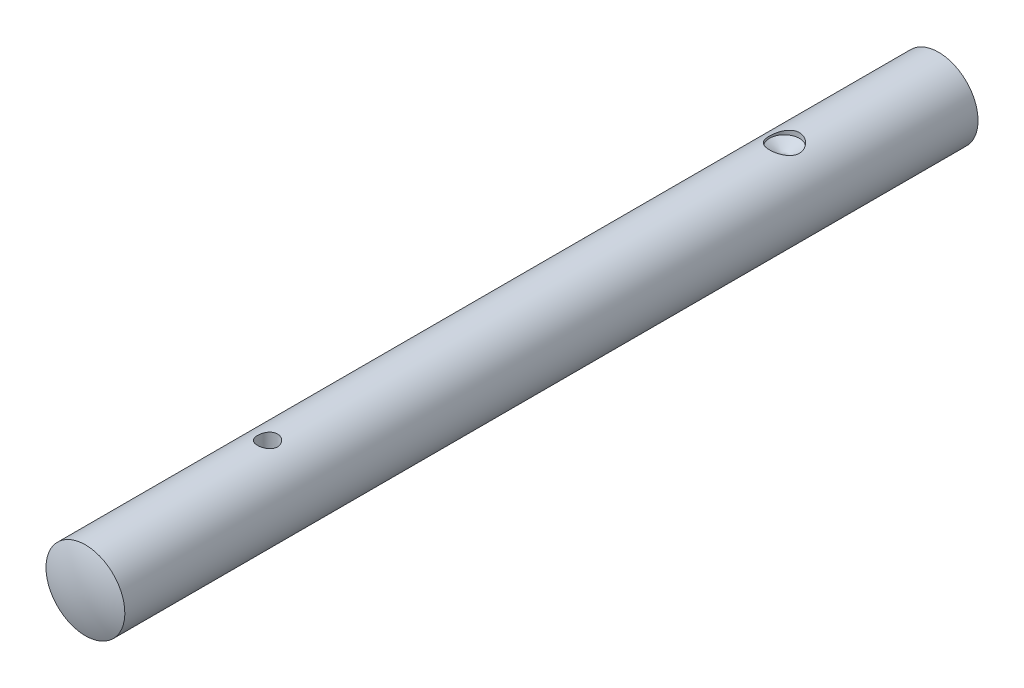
ISO-10303-21;
HEADER;
FILE_DESCRIPTION(('STEP AP214'),'2;1');
FILE_NAME('part.step','',(''),(''),'','','');
FILE_SCHEMA(('AUTOMOTIVE_DESIGN { 1 0 10303 214 1 1 1 1 }'));
ENDSEC;
DATA;
#1=APPLICATION_CONTEXT('core data for automotive mechanical design processes');
#2=APPLICATION_PROTOCOL_DEFINITION('international standard','automotive_design',2000,#1);
#3=PRODUCT_CONTEXT('',#1,'mechanical');
#4=PRODUCT('Part','Part','',(#3));
#5=PRODUCT_RELATED_PRODUCT_CATEGORY('part','',(#4));
#6=PRODUCT_DEFINITION_FORMATION('','',#4);
#7=PRODUCT_DEFINITION_CONTEXT('part definition',#1,'design');
#8=PRODUCT_DEFINITION('design','',#6,#7);
#9=PRODUCT_DEFINITION_SHAPE('','',#8);
#10=(LENGTH_UNIT() NAMED_UNIT(*) SI_UNIT(.MILLI.,.METRE.));
#11=(NAMED_UNIT(*) PLANE_ANGLE_UNIT() SI_UNIT($,.RADIAN.));
#12=(NAMED_UNIT(*) SI_UNIT($,.STERADIAN.) SOLID_ANGLE_UNIT());
#13=UNCERTAINTY_MEASURE_WITH_UNIT(LENGTH_MEASURE(1.E-05),#10,'distance_accuracy_value','');
#14=(GEOMETRIC_REPRESENTATION_CONTEXT(3) GLOBAL_UNCERTAINTY_ASSIGNED_CONTEXT((#13)) GLOBAL_UNIT_ASSIGNED_CONTEXT((#10,
#11,#12)) REPRESENTATION_CONTEXT('',''));
#15=CARTESIAN_POINT('',(0.,0.,0.));
#16=DIRECTION('',(0.,0.,1.));
#17=DIRECTION('',(1.,0.,0.));
#18=AXIS2_PLACEMENT_3D('',#15,#16,#17);
#19=CARTESIAN_POINT('',(0.,0.,-174.));
#20=DIRECTION('',(0.,0.,1.));
#21=DIRECTION('',(1.,0.,0.));
#22=AXIS2_PLACEMENT_3D('',#19,#20,#21);
#23=CYLINDRICAL_SURFACE('',#22,7.9);
#24=CARTESIAN_POINT('',(0.,0.,-172.5));
#25=DIRECTION('',(0.,0.,-1.));
#26=DIRECTION('',(-1.,0.,0.));
#27=AXIS2_PLACEMENT_3D('',#24,#25,#26);
#28=CIRCLE('',#27,7.89999999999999);
#29=CARTESIAN_POINT('',(-7.89999999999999,0.,-172.5));
#30=VERTEX_POINT('',#29);
#31=EDGE_CURVE('E77',#30,#30,#28,.T.);
#32=ORIENTED_EDGE('',*,*,#31,.F.);
#33=EDGE_LOOP('',(#32));
#34=FACE_BOUND('',#33,.T.);
#35=CARTESIAN_POINT('',(0.,0.,-1.5));
#36=DIRECTION('',(0.,0.,-1.));
#37=DIRECTION('',(-1.,0.,0.));
#38=AXIS2_PLACEMENT_3D('',#35,#36,#37);
#39=CIRCLE('',#38,7.89999999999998);
#40=CARTESIAN_POINT('',(-7.89999999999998,0.,-1.5));
#41=VERTEX_POINT('',#40);
#42=EDGE_CURVE('E79',#41,#41,#39,.T.);
#43=ORIENTED_EDGE('',*,*,#42,.T.);
#44=EDGE_LOOP('',(#43));
#45=FACE_BOUND('',#44,.T.);
#46=CARTESIAN_POINT('',(0.,7.9,-138.6));
#47=CARTESIAN_POINT('',(0.162323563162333,7.90000492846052,-138.599993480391));
#48=CARTESIAN_POINT('',(0.324603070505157,7.89495384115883,-138.613215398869));
#49=CARTESIAN_POINT('',(0.644304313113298,7.87530990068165,-138.6655331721));
#50=CARTESIAN_POINT('',(0.801726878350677,7.86071868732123,-138.704624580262));
#51=CARTESIAN_POINT('',(1.10705675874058,7.82355831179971,-138.807094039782));
#52=CARTESIAN_POINT('',(1.25498205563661,7.8010047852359,-138.870424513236));
#53=CARTESIAN_POINT('',(1.53809584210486,7.75015966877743,-139.019329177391));
#54=CARTESIAN_POINT('',(1.67328081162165,7.72186649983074,-139.104909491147));
#55=CARTESIAN_POINT('',(1.93294231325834,7.66108451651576,-139.299760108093));
#56=CARTESIAN_POINT('',(2.05679326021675,7.62847488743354,-139.409826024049));
#57=CARTESIAN_POINT('',(2.2847856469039,7.5633219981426,-139.648834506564));
#58=CARTESIAN_POINT('',(2.38892082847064,7.53077876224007,-139.777783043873));
#59=CARTESIAN_POINT('',(2.57855473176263,7.46802796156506,-140.057067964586));
#60=CARTESIAN_POINT('',(2.66316106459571,7.43796229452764,-140.208045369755));
#61=CARTESIAN_POINT('',(2.80550179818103,7.3854558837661,-140.52340717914));
#62=CARTESIAN_POINT('',(2.86324724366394,7.36301200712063,-140.687786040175));
#63=CARTESIAN_POINT('',(2.94774292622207,7.32958460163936,-141.018076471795));
#64=CARTESIAN_POINT('',(2.9756892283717,7.31816074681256,-141.183635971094));
#65=CARTESIAN_POINT('',(3.00353256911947,7.3067805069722,-141.517458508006));
#66=CARTESIAN_POINT('',(3.00344157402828,7.30681922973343,-141.685720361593));
#67=CARTESIAN_POINT('',(2.97612591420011,7.31798087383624,-142.009128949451));
#68=CARTESIAN_POINT('',(2.95057362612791,7.32842061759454,-142.164444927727));
#69=CARTESIAN_POINT('',(2.8758298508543,7.35807053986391,-142.468392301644));
#70=CARTESIAN_POINT('',(2.82663471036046,7.37728207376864,-142.617022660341));
#71=CARTESIAN_POINT('',(2.70510349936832,7.42271363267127,-142.906741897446));
#72=CARTESIAN_POINT('',(2.63234090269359,7.44906124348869,-143.047630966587));
#73=CARTESIAN_POINT('',(2.46603791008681,7.50575515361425,-143.31567956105));
#74=CARTESIAN_POINT('',(2.37249021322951,7.5361028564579,-143.442834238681));
#75=CARTESIAN_POINT('',(2.15966803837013,7.599933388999,-143.689042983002));
#76=CARTESIAN_POINT('',(2.03906303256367,7.6334879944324,-143.806931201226));
#77=CARTESIAN_POINT('',(1.779414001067,7.69815357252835,-144.02116053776));
#78=CARTESIAN_POINT('',(1.64036700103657,7.72926414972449,-144.117498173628));
#79=CARTESIAN_POINT('',(1.34474573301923,7.78618320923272,-144.287221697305));
#80=CARTESIAN_POINT('',(1.18792377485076,7.81189751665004,-144.36021000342));
#81=CARTESIAN_POINT('',(0.863006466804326,7.85442576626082,-144.478378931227));
#82=CARTESIAN_POINT('',(0.694916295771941,7.87124376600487,-144.523572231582));
#83=CARTESIAN_POINT('',(0.362038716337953,7.89336633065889,-144.582605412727));
#84=CARTESIAN_POINT('',(0.197567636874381,7.89924652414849,-144.598014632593));
#85=CARTESIAN_POINT('',(-0.131696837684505,7.90061616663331,-144.601623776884));
#86=CARTESIAN_POINT('',(-0.296490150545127,7.89610798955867,-144.589829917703));
#87=CARTESIAN_POINT('',(-0.614878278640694,7.87758675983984,-144.540553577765));
#88=CARTESIAN_POINT('',(-0.768658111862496,7.86395727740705,-144.504107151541));
#89=CARTESIAN_POINT('',(-1.06780562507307,7.82895197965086,-144.40793284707));
#90=CARTESIAN_POINT('',(-1.21317220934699,7.80757515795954,-144.348201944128));
#91=CARTESIAN_POINT('',(-1.49620091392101,7.75839143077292,-144.205237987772));
#92=CARTESIAN_POINT('',(-1.63350675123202,7.73041265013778,-144.121360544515));
#93=CARTESIAN_POINT('',(-1.89255944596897,7.67110861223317,-143.933210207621));
#94=CARTESIAN_POINT('',(-2.01430042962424,7.63978209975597,-143.828929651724));
#95=CARTESIAN_POINT('',(-2.24635084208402,7.57491147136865,-143.595634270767));
#96=CARTESIAN_POINT('',(-2.35554865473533,7.5413463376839,-143.465516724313));
#97=CARTESIAN_POINT('',(-2.55078898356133,7.47757010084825,-143.188155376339));
#98=CARTESIAN_POINT('',(-2.63682912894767,7.44735934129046,-143.040909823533));
#99=CARTESIAN_POINT('',(-2.78347589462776,7.3938095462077,-142.732083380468));
#100=CARTESIAN_POINT('',(-2.84395092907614,7.37050624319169,-142.570433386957));
#101=CARTESIAN_POINT('',(-2.93641182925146,7.33416669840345,-142.238108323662));
#102=CARTESIAN_POINT('',(-2.96841593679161,7.32112388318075,-142.06743910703));
#103=CARTESIAN_POINT('',(-3.00137459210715,7.30766976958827,-141.733999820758));
#104=CARTESIAN_POINT('',(-3.0042309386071,7.30648488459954,-141.571447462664));
#105=CARTESIAN_POINT('',(-2.98370805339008,7.31488942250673,-141.24830705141));
#106=CARTESIAN_POINT('',(-2.96033144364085,7.32447776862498,-141.08771880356));
#107=CARTESIAN_POINT('',(-2.88950106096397,7.35269714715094,-140.778307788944));
#108=CARTESIAN_POINT('',(-2.842844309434,7.37102800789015,-140.629272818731));
#109=CARTESIAN_POINT('',(-2.72748799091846,7.41448510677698,-140.341063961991));
#110=CARTESIAN_POINT('',(-2.65878278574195,7.43961308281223,-140.201892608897));
#111=CARTESIAN_POINT('',(-2.49702772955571,7.49550108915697,-139.929282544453));
#112=CARTESIAN_POINT('',(-2.40287428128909,7.52649013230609,-139.796546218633));
#113=CARTESIAN_POINT('',(-2.194585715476,7.58983751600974,-139.548150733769));
#114=CARTESIAN_POINT('',(-2.08044416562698,7.62219629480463,-139.432497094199));
#115=CARTESIAN_POINT('',(-1.82777523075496,7.68681633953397,-139.214932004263));
#116=CARTESIAN_POINT('',(-1.68823948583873,7.71897044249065,-139.114154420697));
#117=CARTESIAN_POINT('',(-1.39308007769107,7.77765724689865,-138.937499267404));
#118=CARTESIAN_POINT('',(-1.237454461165,7.80418926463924,-138.86162472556));
#119=CARTESIAN_POINT('',(-0.905552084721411,7.84980684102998,-138.73412624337));
#120=CARTESIAN_POINT('',(-0.728613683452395,7.86841215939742,-138.684035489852));
#121=CARTESIAN_POINT('',(-0.367762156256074,7.89350270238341,-138.616984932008));
#122=CARTESIAN_POINT('',(-0.183852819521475,7.8999944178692,-138.600007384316));
#123=CARTESIAN_POINT('',(0.,7.9,-138.6));
#124=B_SPLINE_CURVE_WITH_KNOTS('',3,(#46,#47,#48,#49,#50,#51,#52,#53,#54,#55,#56,#57,#58,#59,
#60,#61,#62,#63,#64,#65,#66,#67,#68,#69,#70,#71,#72,#73,#74,#75,#76,#77,#78,#79,#80,#81,#82,#83,
#84,#85,#86,#87,#88,#89,#90,#91,#92,#93,#94,#95,#96,#97,#98,#99,#100,#101,#102,#103,#104,#105,
#106,#107,#108,#109,#110,#111,#112,#113,#114,#115,#116,#117,#118,#119,#120,#121,#122,#123),
.UNSPECIFIED.,.T.,.F.,(4,2,2,2,2,2,2,2,2,2,2,2,2,2,2,2,2,2,2,2,2,2,2,2,2,2,2,2,2,2,2,2,2,2,2,2,
2,2,4),(0.,0.486292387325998,0.972501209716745,1.4577605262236,1.94315352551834,
2.44753025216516,2.95206681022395,3.47641548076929,4.00054835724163,4.50274522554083,
5.00472775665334,5.4757771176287,5.94689928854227,6.42707488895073,6.9074194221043,
7.4209362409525,7.93453598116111,8.45646550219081,8.97815676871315,9.47151821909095,
9.96476693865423,10.4384776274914,10.9122498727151,11.4000709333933,11.8880755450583,
12.4051248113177,12.9222269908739,13.4419592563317,13.9613582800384,14.4466330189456,
14.9318592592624,15.4015086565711,15.8712782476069,16.3661200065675,16.8611213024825,
17.3838725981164,17.9066874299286,18.4577729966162,19.0085631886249),.UNSPECIFIED.);
#125=CARTESIAN_POINT('',(0.,7.9,-138.6));
#126=VERTEX_POINT('',#125);
#127=EDGE_CURVE('E13',#126,#126,#124,.T.);
#128=ORIENTED_EDGE('',*,*,#127,.F.);
#129=EDGE_LOOP('',(#128));
#130=FACE_BOUND('',#129,.T.);
#131=CARTESIAN_POINT('',(0.,7.9,-36.));
#132=CARTESIAN_POINT('',(0.110455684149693,7.89999816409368,-36.0000030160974));
#133=CARTESIAN_POINT('',(0.22094479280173,7.8976604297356,-36.0091811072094));
#134=CARTESIAN_POINT('',(0.438753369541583,7.88856135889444,-36.0455941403));
#135=CARTESIAN_POINT('',(0.546071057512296,7.88179758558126,-36.0728390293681));
#136=CARTESIAN_POINT('',(0.754360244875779,7.86459496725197,-36.1444531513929));
#137=CARTESIAN_POINT('',(0.855339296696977,7.85416059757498,-36.18880153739));
#138=CARTESIAN_POINT('',(1.04842483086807,7.83072646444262,-36.293289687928));
#139=CARTESIAN_POINT('',(1.14053095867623,7.8177265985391,-36.3534300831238));
#140=CARTESIAN_POINT('',(1.31519757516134,7.79026495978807,-36.4891339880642));
#141=CARTESIAN_POINT('',(1.3975443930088,7.77578017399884,-36.5649678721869));
#142=CARTESIAN_POINT('',(1.5484973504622,7.74713314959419,-36.7293274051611));
#143=CARTESIAN_POINT('',(1.61710189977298,7.73297094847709,-36.8178545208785));
#144=CARTESIAN_POINT('',(1.7396346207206,7.7063399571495,-37.0067552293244));
#145=CARTESIAN_POINT('',(1.79332251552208,7.69390034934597,-37.1072891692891));
#146=CARTESIAN_POINT('',(1.88295228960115,7.67245912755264,-37.3163214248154));
#147=CARTESIAN_POINT('',(1.91889708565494,7.66345694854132,-37.4248184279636));
#148=CARTESIAN_POINT('',(1.97128895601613,7.65014656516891,-37.6443442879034));
#149=CARTESIAN_POINT('',(1.98812081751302,7.6457458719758,-37.7552755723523));
#150=CARTESIAN_POINT('',(2.00300778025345,7.64185997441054,-37.9784679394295));
#151=CARTESIAN_POINT('',(2.00106601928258,7.64237394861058,-38.090728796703));
#152=CARTESIAN_POINT('',(1.97876757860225,7.64817623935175,-38.3104345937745));
#153=CARTESIAN_POINT('',(1.95887071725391,7.65334533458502,-38.417929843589));
#154=CARTESIAN_POINT('',(1.90196093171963,7.66768527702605,-38.628004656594));
#155=CARTESIAN_POINT('',(1.86494676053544,7.67685641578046,-38.730583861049));
#156=CARTESIAN_POINT('',(1.77446439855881,7.69827566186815,-38.9291413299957));
#157=CARTESIAN_POINT('',(1.7208303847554,7.71055453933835,-39.0250405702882));
#158=CARTESIAN_POINT('',(1.59874672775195,7.73678852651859,-39.2066421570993));
#159=CARTESIAN_POINT('',(1.5302944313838,7.7507439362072,-39.2923426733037));
#160=CARTESIAN_POINT('',(1.37814120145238,7.77925948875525,-39.4537476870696));
#161=CARTESIAN_POINT('',(1.29405258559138,7.79382537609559,-39.5290861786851));
#162=CARTESIAN_POINT('',(1.11425951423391,7.82155271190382,-39.6646628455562));
#163=CARTESIAN_POINT('',(1.01855468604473,7.83471411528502,-39.7249005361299));
#164=CARTESIAN_POINT('',(0.817715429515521,7.85821780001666,-39.828704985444));
#165=CARTESIAN_POINT('',(0.712548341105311,7.868549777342,-39.8722110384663));
#166=CARTESIAN_POINT('',(0.496073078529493,7.88515563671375,-39.940823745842));
#167=CARTESIAN_POINT('',(0.384766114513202,7.89143031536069,-39.96593401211));
#168=CARTESIAN_POINT('',(0.162298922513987,7.89909622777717,-39.9964804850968));
#169=CARTESIAN_POINT('',(0.0512112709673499,7.90061111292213,-40.0024149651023));
#170=CARTESIAN_POINT('',(-0.170370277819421,7.89893954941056,-39.9958097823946));
#171=CARTESIAN_POINT('',(-0.280864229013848,7.89575353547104,-39.9832718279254));
#172=CARTESIAN_POINT('',(-0.496381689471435,7.88511751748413,-39.9404880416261));
#173=CARTESIAN_POINT('',(-0.601462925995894,7.87773327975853,-39.9105151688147));
#174=CARTESIAN_POINT('',(-0.805099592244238,7.8595340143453,-39.8340251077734));
#175=CARTESIAN_POINT('',(-0.903654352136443,7.84871863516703,-39.7875062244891));
#176=CARTESIAN_POINT('',(-1.09341434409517,7.82456180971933,-39.6782866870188));
#177=CARTESIAN_POINT('',(-1.18445430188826,7.81117819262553,-39.6153084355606));
#178=CARTESIAN_POINT('',(-1.35485026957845,7.78343409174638,-39.4753116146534));
#179=CARTESIAN_POINT('',(-1.43420420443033,7.76907343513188,-39.3982905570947));
#180=CARTESIAN_POINT('',(-1.58103757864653,7.74054683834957,-39.2300786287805));
#181=CARTESIAN_POINT('',(-1.64816709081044,7.72639494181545,-39.1385793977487));
#182=CARTESIAN_POINT('',(-1.76611992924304,7.70029116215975,-38.9453217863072));
#183=CARTESIAN_POINT('',(-1.81694397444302,7.68833918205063,-38.8435638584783));
#184=CARTESIAN_POINT('',(-1.90046316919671,7.66812147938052,-38.6332179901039));
#185=CARTESIAN_POINT('',(-1.93326558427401,7.65983400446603,-38.5246748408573));
#186=CARTESIAN_POINT('',(-1.98008836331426,7.64786539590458,-38.303371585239));
#187=CARTESIAN_POINT('',(-1.99411296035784,7.64418322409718,-38.1906124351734));
#188=CARTESIAN_POINT('',(-2.00275659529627,7.64192268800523,-37.9676427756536));
#189=CARTESIAN_POINT('',(-1.99793548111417,7.64319707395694,-37.8574551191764));
#190=CARTESIAN_POINT('',(-1.97030906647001,7.65036481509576,-37.6395188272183));
#191=CARTESIAN_POINT('',(-1.94750414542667,7.65625807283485,-37.5317701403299));
#192=CARTESIAN_POINT('',(-1.88486680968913,7.67191641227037,-37.3223968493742));
#193=CARTESIAN_POINT('',(-1.84514192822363,7.68165701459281,-37.2207381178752));
#194=CARTESIAN_POINT('',(-1.74987702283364,7.70391540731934,-37.0254549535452));
#195=CARTESIAN_POINT('',(-1.69433475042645,7.71643359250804,-36.9318316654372));
#196=CARTESIAN_POINT('',(-1.56726739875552,7.74325442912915,-36.7525777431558));
#197=CARTESIAN_POINT('',(-1.49535503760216,7.7575958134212,-36.6672273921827));
#198=CARTESIAN_POINT('',(-1.33834018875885,7.7862187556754,-36.5096234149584));
#199=CARTESIAN_POINT('',(-1.25323456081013,7.80050029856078,-36.4373729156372));
#200=CARTESIAN_POINT('',(-1.07032790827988,7.82771329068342,-36.3066999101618));
#201=CARTESIAN_POINT('',(-0.972319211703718,7.84061449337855,-36.2485613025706));
#202=CARTESIAN_POINT('',(-0.767600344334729,7.86329202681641,-36.1496780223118));
#203=CARTESIAN_POINT('',(-0.66089635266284,7.87307055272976,-36.1089211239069));
#204=CARTESIAN_POINT('',(-0.462016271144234,7.8869886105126,-36.0518731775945));
#205=CARTESIAN_POINT('',(-0.370771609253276,7.89183399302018,-36.0324633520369));
#206=CARTESIAN_POINT('',(-0.186359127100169,7.89834033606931,-36.0065260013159));
#207=CARTESIAN_POINT('',(-0.0931914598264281,7.90000154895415,-35.9999974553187));
#208=CARTESIAN_POINT('',(0.,7.9,-36.));
#209=B_SPLINE_CURVE_WITH_KNOTS('',3,(#131,#132,#133,#134,#135,#136,#137,#138,#139,#140,#141,
#142,#143,#144,#145,#146,#147,#148,#149,#150,#151,#152,#153,#154,#155,#156,#157,#158,#159,#160,
#161,#162,#163,#164,#165,#166,#167,#168,#169,#170,#171,#172,#173,#174,#175,#176,#177,#178,#179,
#180,#181,#182,#183,#184,#185,#186,#187,#188,#189,#190,#191,#192,#193,#194,#195,#196,#197,#198,
#199,#200,#201,#202,#203,#204,#205,#206,#207,#208),.UNSPECIFIED.,.T.,.F.,(4,2,2,2,2,2,2,2,2,2,2,
2,2,2,2,2,2,2,2,2,2,2,2,2,2,2,2,2,2,2,2,2,2,2,2,2,2,2,4),(0.,0.331025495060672,
0.662233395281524,0.993038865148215,1.3238575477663,1.66093776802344,1.99805697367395,
2.34032744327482,2.68254162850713,3.01773682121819,3.35287599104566,3.67966869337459,
4.00648520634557,4.33667362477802,4.66692121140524,5.0068351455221,5.34675998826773,
5.68790676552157,6.02898654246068,6.36112910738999,6.69324095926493,7.02028814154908,
7.34736883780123,7.68036850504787,8.01342723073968,8.35488526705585,8.69632824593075,
9.03571629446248,9.37502782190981,9.70433716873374,10.0336395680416,10.3608796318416,
10.6881662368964,11.0241948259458,11.3603035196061,11.7026984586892,12.0448521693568,
12.324160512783,12.6034467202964),.UNSPECIFIED.);
#210=CARTESIAN_POINT('',(0.,7.9,-36.));
#211=VERTEX_POINT('',#210);
#212=EDGE_CURVE('E57',#211,#211,#209,.T.);
#213=ORIENTED_EDGE('',*,*,#212,.F.);
#214=EDGE_LOOP('',(#213));
#215=FACE_BOUND('',#214,.T.);
#216=ADVANCED_FACE('F46',(#34,#45,#130,#215),#23,.T.);
#217=CARTESIAN_POINT('',(0.,2.9,-38.));
#218=DIRECTION('',(0.,1.,0.));
#219=DIRECTION('',(0.,0.,1.));
#220=AXIS2_PLACEMENT_3D('',#217,#218,#219);
#221=CONICAL_SURFACE('',#220,1.99999999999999,1.02974425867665);
#222=CARTESIAN_POINT('',(0.,1.69827876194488,-38.));
#223=VERTEX_POINT('',#222);
#224=VERTEX_LOOP('',#223);
#225=FACE_BOUND('',#224,.T.);
#226=CARTESIAN_POINT('',(0.,2.9,-38.));
#227=DIRECTION('',(0.,1.,0.));
#228=DIRECTION('',(0.,0.,1.));
#229=AXIS2_PLACEMENT_3D('',#226,#227,#228);
#230=CIRCLE('',#229,1.99999999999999);
#231=CARTESIAN_POINT('',(0.,2.9,-36.));
#232=VERTEX_POINT('',#231);
#233=EDGE_CURVE('E87',#232,#232,#230,.T.);
#234=ORIENTED_EDGE('',*,*,#233,.T.);
#235=EDGE_LOOP('',(#234));
#236=FACE_BOUND('',#235,.T.);
#237=ADVANCED_FACE('F98',(#225,#236),#221,.F.);
#238=CARTESIAN_POINT('',(0.,7.9,-38.));
#239=DIRECTION('',(0.,1.,0.));
#240=DIRECTION('',(0.,0.,1.));
#241=AXIS2_PLACEMENT_3D('',#238,#239,#240);
#242=CYLINDRICAL_SURFACE('',#241,1.99999999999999);
#243=ORIENTED_EDGE('',*,*,#212,.T.);
#244=EDGE_LOOP('',(#243));
#245=FACE_BOUND('',#244,.T.);
#246=ORIENTED_EDGE('',*,*,#233,.F.);
#247=EDGE_LOOP('',(#246));
#248=FACE_BOUND('',#247,.T.);
#249=ADVANCED_FACE('F93',(#245,#248),#242,.F.);
#250=CARTESIAN_POINT('',(0.,6.9,-141.6));
#251=DIRECTION('',(0.,1.,0.));
#252=DIRECTION('',(0.,0.,1.));
#253=AXIS2_PLACEMENT_3D('',#250,#251,#252);
#254=CONICAL_SURFACE('',#253,3.,1.02974425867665);
#255=CARTESIAN_POINT('',(0.,5.09741814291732,-141.6));
#256=VERTEX_POINT('',#255);
#257=VERTEX_LOOP('',#256);
#258=FACE_BOUND('',#257,.T.);
#259=CARTESIAN_POINT('',(0.,6.9,-141.6));
#260=DIRECTION('',(0.,1.,0.));
#261=DIRECTION('',(0.,0.,1.));
#262=AXIS2_PLACEMENT_3D('',#259,#260,#261);
#263=CIRCLE('',#262,3.);
#264=CARTESIAN_POINT('',(0.,6.9,-138.6));
#265=VERTEX_POINT('',#264);
#266=EDGE_CURVE('E82',#265,#265,#263,.T.);
#267=ORIENTED_EDGE('',*,*,#266,.T.);
#268=EDGE_LOOP('',(#267));
#269=FACE_BOUND('',#268,.T.);
#270=ADVANCED_FACE('F97',(#258,#269),#254,.F.);
#271=CARTESIAN_POINT('',(0.,7.9,-141.6));
#272=DIRECTION('',(0.,1.,0.));
#273=DIRECTION('',(0.,0.,1.));
#274=AXIS2_PLACEMENT_3D('',#271,#272,#273);
#275=CYLINDRICAL_SURFACE('',#274,3.);
#276=ORIENTED_EDGE('',*,*,#127,.T.);
#277=EDGE_LOOP('',(#276));
#278=FACE_BOUND('',#277,.T.);
#279=ORIENTED_EDGE('',*,*,#266,.F.);
#280=EDGE_LOOP('',(#279));
#281=FACE_BOUND('',#280,.T.);
#282=ADVANCED_FACE('F116',(#278,#281),#275,.F.);
#283=CARTESIAN_POINT('',(0.,0.,-21.5533333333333));
#284=DIRECTION('',(0.,0.,-1.));
#285=DIRECTION('',(0.,1.,0.));
#286=AXIS2_PLACEMENT_3D('',#283,#284,#285);
#287=SPHERICAL_SURFACE('',#286,21.5533333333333);
#288=CARTESIAN_POINT('',(0.,0.,0.));
#289=VERTEX_POINT('',#288);
#290=VERTEX_LOOP('',#289);
#291=FACE_BOUND('',#290,.T.);
#292=ORIENTED_EDGE('',*,*,#42,.F.);
#293=EDGE_LOOP('',(#292));
#294=FACE_BOUND('',#293,.T.);
#295=ADVANCED_FACE('F73',(#291,#294),#287,.T.);
#296=CARTESIAN_POINT('',(0.,0.,-152.446666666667));
#297=DIRECTION('',(0.,0.,-1.));
#298=DIRECTION('',(0.,-1.,0.));
#299=AXIS2_PLACEMENT_3D('',#296,#297,#298);
#300=SPHERICAL_SURFACE('',#299,21.5533333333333);
#301=CARTESIAN_POINT('',(0.,0.,-174.));
#302=VERTEX_POINT('',#301);
#303=VERTEX_LOOP('',#302);
#304=FACE_BOUND('',#303,.T.);
#305=ORIENTED_EDGE('',*,*,#31,.T.);
#306=EDGE_LOOP('',(#305));
#307=FACE_BOUND('',#306,.T.);
#308=ADVANCED_FACE('F70',(#304,#307),#300,.T.);
#309=CLOSED_SHELL('',(#216,#237,#249,#270,#282,#295,#308));
#310=MANIFOLD_SOLID_BREP('B2',#309);
#311=ADVANCED_BREP_SHAPE_REPRESENTATION('',(#18,#310),#14);
#312=SHAPE_DEFINITION_REPRESENTATION(#9,#311);
ENDSEC;
END-ISO-10303-21;
